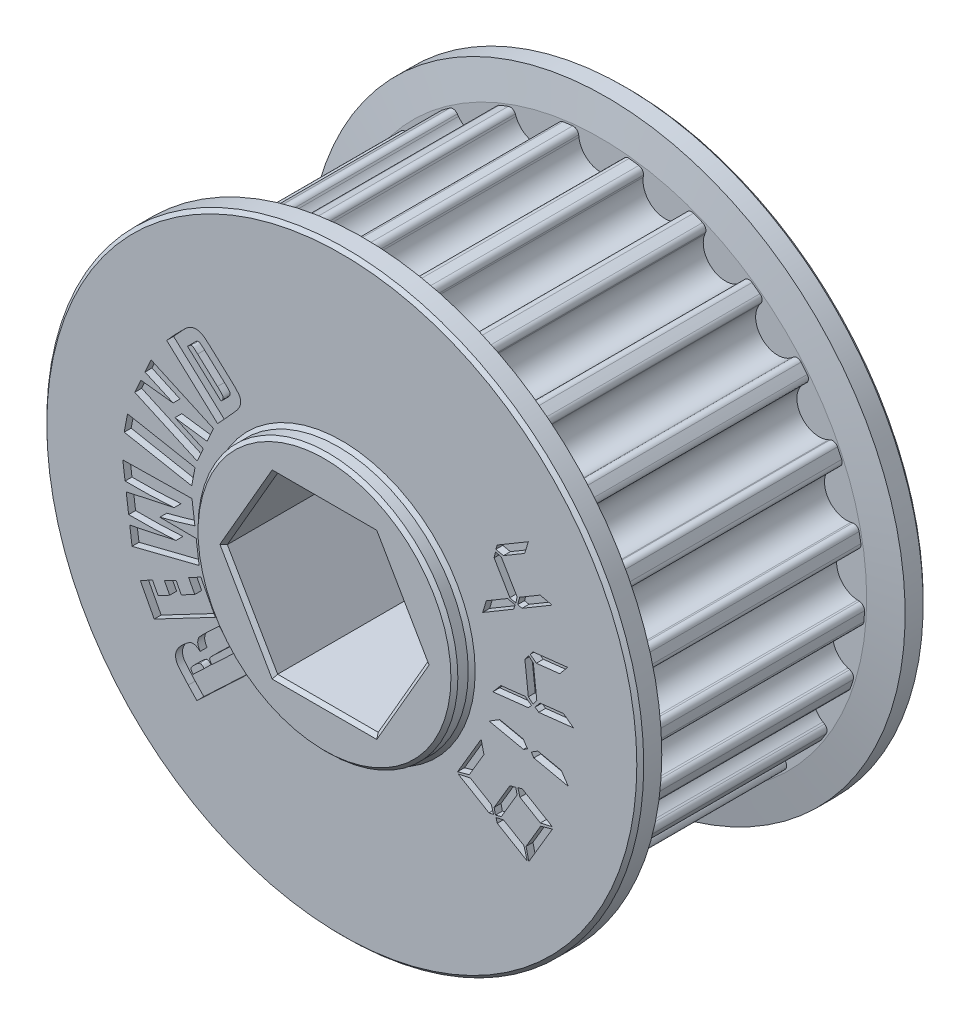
from build123d import *
from OCP.BRepFilletAPI import BRepFilletAPI_MakeChamfer

# Parameters (mm, degrees)
SKETCH2_R                                 = 19.346823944
PULLEY_DEPTH                              = 8.500000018
CUT_TOOTH_DEPTH                           = 8.500000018
BLEND_TOOTH_R                             = 0.4
TOOTH_PATTERN_COUNT                       = 25
BLEND_TOOTH_OF_TOOTH_PATTERN_R            = 0.4
SIDEWALL_START                            = 8.500000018
SKETCH3_R                                 = 21.886823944
SIDEWALL_DEPTH                            = 2.000000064
SIDEWALL_CHAMFER_SIZE                     = 2.400000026
SIDEWALL_CHAMFER_SIZE2                    = 0.423184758
BEARING_SPACER_MANUAL_SUPPRESS_DEPTH      = 11.770000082
BEARING_SPACER_MANUAL_SUPPRESS_DEPTH_BACK = 11.770000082
SKETCH5_R                                 = 9.525
HEX_SHAFT_DEPTH                           = 63.5
CHAMFERS_SIZE                             = 0.254
CUT_EXTRUDE_START                         = 9.992000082
CUT_EXTRUDE_4419_DEPTH                    = 2.54


with BuildPart() as part:
    # Sketch2 → pulley (new, symmetric)
    with BuildSketch(Plane.XY):
        Circle(SKETCH2_R)
    extrude(amount=PULLEY_DEPTH, both=True)

    # tooth → cut tooth (cut, symmetric)
    with BuildSketch(Plane.XY):
        with BuildLine():
            Line((-2.132711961, 22.982416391), (-1.612887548, 18.748786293))
            ThreePointArc((-1.612887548, 18.748786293), (0, 17.32182393), (1.612887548, 18.748786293))
            Line((1.612887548, 18.748786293), (2.132711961, 22.982416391))
            Line((2.132711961, 22.982416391), (-2.132711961, 22.982416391))
        make_face()
    cut_tooth = extrude(amount=CUT_TOOTH_DEPTH, both=True, mode=Mode.SUBTRACT)

    # blend tooth
    blend_tooth_edges = [part.edges().sort_by_distance(p)[0] for p in [
        (1.677372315, 19.273972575, 0),
        (-1.677372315, 19.273972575, 0),
    ]]
    fillet(blend_tooth_edges, radius=BLEND_TOOTH_R)

    # tooth pattern: cut tooth ×25 about axis
    tooth_pattern_axis = Axis((0, 0, 0), (0, 0, 1))
    for i in range(1, TOOTH_PATTERN_COUNT):
        add(cut_tooth.rotate(tooth_pattern_axis, i * 360 / TOOTH_PATTERN_COUNT), mode=Mode.SUBTRACT)

    # blend tooth of tooth pattern
    blend_tooth_of_tooth_pattern_edges = [part.edges().sort_by_distance(p)[0] for p in [
        (-3.168567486, 19.085590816, 0),
        (-6.417916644, 18.251299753, 0),
        (-7.815414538, 17.697991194, 0),
        (-10.755199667, 16.081830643, 0),
        (-11.971190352, 15.198361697, 0),
        (-14.41669394, 12.901880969, 0),
        (-15.374772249, 11.743763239, 0),
        (-17.172334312, 8.911258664, 0),
        (-17.812300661, 7.551260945, 0),
        (-18.848973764, 4.360709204, 0),
        (-19.130616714, 2.884285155, 0),
        (-19.341262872, -0.463839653, 0),
        (-19.246885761, -1.963920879, 0),
        (-18.618269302, -5.259243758, 0),
        (-18.153802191, -6.688726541, 0),
        (-16.725421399, -9.724190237, 0),
        (-15.920048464, -10.993254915, 0),
        (-13.781653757, -13.578130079, 0),
        (-12.685979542, -14.607036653, 0),
        (-9.971934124, -16.578906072, 0),
        (-8.654803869, -17.303004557, 0),
        (-5.535641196, -18.537968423, 0),
        (-4.07981504, -18.911761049, 0),
        (-0.751523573, -19.332222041, 0),
        (0.751523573, -19.332222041, 0),
        (4.07981504, -18.911761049, 0),
        (5.535641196, -18.537968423, 0),
        (8.654803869, -17.303004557, 0),
        (9.971934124, -16.578906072, 0),
        (12.685979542, -14.607036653, 0),
        (13.781653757, -13.578130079, 0),
        (15.920048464, -10.993254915, 0),
        (16.725421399, -9.724190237, 0),
        (18.153802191, -6.688726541, 0),
        (18.618269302, -5.259243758, 0),
        (19.246885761, -1.963920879, 0),
        (19.341262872, -0.463839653, 0),
        (19.130616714, 2.884285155, 0),
        (18.848973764, 4.360709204, 0),
        (17.812300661, 7.551260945, 0),
        (17.172334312, 8.911258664, 0),
        (15.374772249, 11.743763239, 0),
        (14.41669394, 12.901880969, 0),
        (11.971190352, 15.198361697, 0),
        (10.755199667, 16.081830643, 0),
        (7.815414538, 17.697991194, 0),
        (6.417916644, 18.251299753, 0),
        (3.168567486, 19.085590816, 0),
    ]]
    fillet(blend_tooth_of_tooth_pattern_edges, radius=BLEND_TOOTH_OF_TOOTH_PATTERN_R)

    # Sketch3 → sidewall (add)
    with BuildSketch(Plane.XY.offset(SIDEWALL_START)):
        Circle(SKETCH3_R)
    sidewall = extrude(amount=SIDEWALL_DEPTH)

    # mirror sidewall: sidewall across plane
    add(sidewall.mirror(Plane.XY))

    # sidewall chamfer: one chamfer whose edges measure the first distance from different faces: ONE call of the kernel's chamfer builder (chamfer() names one face for all edges)
    sidewall_chamfer_edges_1 = [part.edges().sort_by_distance(p)[0] for p in [
        (-21.886823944, 0, 8.500000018),
    ]]
    sidewall_chamfer_side_1 = [part.faces().sort_by_distance(p)[0] for p in [
        (-21.267771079, 0, 8.500000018),
    ]]
    sidewall_chamfer_edges_2 = [part.edges().sort_by_distance(p)[0] for p in [
        (-21.886823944, 0, -8.500000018),
    ]]
    sidewall_chamfer_side_2 = [part.faces().sort_by_distance(p)[0] for p in [
        (-21.267771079, 0, -8.500000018),
    ]]
    sidewall_chamfer = BRepFilletAPI_MakeChamfer(part.part.solid().wrapped)
    for e in sidewall_chamfer_edges_1:
        sidewall_chamfer.Add(SIDEWALL_CHAMFER_SIZE, SIDEWALL_CHAMFER_SIZE2, e.wrapped, sidewall_chamfer_side_1[0].wrapped)  # the first distance lies on this face
    for e in sidewall_chamfer_edges_2:
        sidewall_chamfer.Add(SIDEWALL_CHAMFER_SIZE, SIDEWALL_CHAMFER_SIZE2, e.wrapped, sidewall_chamfer_side_2[0].wrapped)  # the first distance lies on this face
    add(Compound.cast(sidewall_chamfer.Shape()), mode=Mode.REPLACE)

    # Sketch5 → bearing spacer _Manual Suppress (add, two sides: drawn at the far end of the back side and taken through both)
    with BuildSketch(Plane.XY.offset(-BEARING_SPACER_MANUAL_SUPPRESS_DEPTH_BACK)):
        Circle(SKETCH5_R)
    extrude(amount=BEARING_SPACER_MANUAL_SUPPRESS_DEPTH + BEARING_SPACER_MANUAL_SUPPRESS_DEPTH_BACK)

    # Sketch4 → hex shaft (cut, symmetric)
    with BuildSketch(Plane.XY):
        Polygon((3.688171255, 6.3881), (-3.688171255, 6.3881), (-7.376342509, 0), (-3.688171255, -6.3881), (3.688171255, -6.3881), (7.376342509, 0), align=None)
    extrude(amount=HEX_SHAFT_DEPTH, both=True, mode=Mode.SUBTRACT)

    # chamfers
    chamfers_edges = [part.edges().sort_by_distance(p)[0] for p in [
        (-21.886823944, 0, 10.500000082),
        (-21.886823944, 0, -10.500000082),
        (-9.525, 0, -10.500000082),
        (-9.525, 0, 10.500000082),
        (-9.525, 0, -11.770000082),
        (-9.525, 0, 11.770000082),
        (0, 6.3881, 11.770000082),
        (-5.532256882, 3.19405, 11.770000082),
        (-5.532256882, -3.19405, 11.770000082),
        (0, -6.3881, 11.770000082),
        (5.532256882, -3.19405, 11.770000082),
        (5.532256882, 3.19405, 11.770000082),
        (5.532256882, 3.19405, -11.770000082),
        (5.532256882, -3.19405, -11.770000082),
        (0, -6.3881, -11.770000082),
        (-5.532256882, -3.19405, -11.770000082),
        (-5.532256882, 3.19405, -11.770000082),
        (0, 6.3881, -11.770000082),
    ]]
    chamfer(chamfers_edges, length=CHAMFERS_SIZE)

    # Sketch6 → Cut-Extrude 4419 (cut)
    # profile 1 of 22: a face of its own
    with BuildSketch(Plane.XY.offset(CUT_EXTRUDE_START)):
        Polygon((11.392131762, 8.850099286), (13.677688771, 10.201222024), (13.40912544, 9.326314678), (11.854503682, 8.405723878), (11.292458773, 8.523393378), align=None)
    # profile 2 of 22: a face of its own
    with BuildSketch(Plane.XY.offset(CUT_EXTRUDE_START)):
        Polygon((12.60620414, 5.382309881), (10.328953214, 4.035340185), (10.597516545, 4.911631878), (12.152138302, 5.830838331), (12.716951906, 5.710400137), align=None)
    # profile 3 of 22: a face of its own
    with BuildSketch(Plane.XY.offset(CUT_EXTRUDE_START)):
        Polygon((13.046426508, 6.359658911), (14.542905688, 7.245641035), (15.419197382, 7.046295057), (13.218085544, 5.745008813), (12.89414833, 5.814226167), align=None)
    # profile 4 of 22: a face of its own
    with BuildSketch(Plane.XY.offset(CUT_EXTRUDE_START)):
        Polygon((12.854002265, 6.286288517), (12.757097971, 5.843297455), (12.322412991, 5.972041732), (11.167867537, 7.925355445), (11.273077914, 8.353118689), (11.699456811, 8.239602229), align=None)
    # profile 5 of 22: a face of its own
    with BuildSketch(Plane.XY.offset(CUT_EXTRUDE_START)):
        Polygon((14.031043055, 3.379982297), (16.558860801, 3.663773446), (15.98297242, 2.970215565), (14.263613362, 2.777791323), (13.816469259, 3.121109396), align=None)
    # profile 6 of 22: a face of its own
    with BuildSketch(Plane.XY.offset(CUT_EXTRUDE_START)):
        Polygon((13.673881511, -0.338373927), (11.074077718, -0.630471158), (11.670731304, 0.06447107), (13.445464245, 0.263817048), (13.906451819, -0.083654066), align=None)
    # profile 7 of 22: a face of its own
    with BuildSketch(Plane.XY.offset(CUT_EXTRUDE_START)):
        Polygon((14.534945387, 0.38563959), (16.263994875, 0.579448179), (16.981086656, 0.032631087), (14.43942544, -0.252544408), (14.172246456, -0.054582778), align=None)
    # profile 8 of 22: a face of its own
    with BuildSketch(Plane.XY.offset(CUT_EXTRUDE_START)):
        Polygon((14.298222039, 0.423016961), (14.025505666, 0.060318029), (13.678034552, 0.353799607), (13.424699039, 2.608900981), (13.697415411, 2.975752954), (14.044886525, 2.678118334), align=None)
    # profile 9 of 22: a face of its own
    with BuildSketch(Plane.XY.offset(CUT_EXTRUDE_START)):
        Polygon((13.32375599, -3.165051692), (10.804244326, -2.625156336), (11.582247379, -2.143403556), (13.301606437, -2.511639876), (13.622774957, -2.987855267), align=None)
    # profile 10 of 22: a face of its own
    with BuildSketch(Plane.XY.offset(CUT_EXTRUDE_START)):
        Polygon((14.375859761, -2.742825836), (16.09521882, -3.111062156), (16.607427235, -3.86968435), (14.079609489, -3.327020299), (13.888569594, -3.044613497), align=None)
    # profile 11 of 22: a face of its own
    with BuildSketch(Plane.XY.offset(CUT_EXTRUDE_START)):
        Polygon((13.712643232, -10.094065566), (13.509144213, -9.226079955), (14.584781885, -7.405663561), (15.444461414, -7.166171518), align=None)
    # profile 12 of 22: a face of its own
    with BuildSketch(Plane.XY.offset(CUT_EXTRUDE_START)):
        Polygon((8.485348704, -7.002818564), (10.217166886, -4.074924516), (10.420665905, -4.942910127), (9.345028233, -6.763326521), align=None)
    # profile 13 of 22: a face of its own
    with BuildSketch(Plane.XY.offset(CUT_EXTRUDE_START)):
        Polygon((13.235043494, -5.718144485), (15.436155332, -7.019430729), (14.559863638, -7.218776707), (13.063384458, -6.332794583), (12.908337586, -5.79151488), align=None)
    # profile 14 of 22: a face of its own
    with BuildSketch(Plane.XY.offset(CUT_EXTRUDE_START)):
        Polygon((10.791670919, -8.457767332), (8.533800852, -7.123256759), (9.425320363, -6.932216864), (10.96609865, -7.844501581), (11.129451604, -8.396856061), align=None)
    # profile 15 of 22: a face of its own
    with BuildSketch(Plane.XY.offset(CUT_EXTRUDE_START)):
        Polygon((11.857618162, -8.370553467), (13.354097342, -9.25653559), (13.601895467, -10.120368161), (11.400783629, -8.819081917), (11.306648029, -8.500682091), align=None)
    # profile 16 of 22: a face of its own
    with BuildSketch(Plane.XY.offset(CUT_EXTRUDE_START)):
        Polygon((11.701186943, -8.239040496), (11.266501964, -8.366400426), (11.169597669, -7.924793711), (12.324143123, -5.971479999), (12.75052202, -5.856579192), (12.855732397, -6.285726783), align=None)
    # profile 17 of 22: a face of its own
    with BuildSketch(Plane.XY.offset(CUT_EXTRUDE_START)):
        with BuildLine():
            Line((-12.843214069, 9.727965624), (-12.17605404, 10.455105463))
            add(Edge.make_bspline(
                [(-12.17605404, 10.455105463), (-12.124197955, 10.511204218), (-12.0250833, 10.618428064), (-11.880869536, 10.770440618), (-11.74720201, 10.905964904), (-11.624816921, 11.025689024), (-11.514233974, 11.12997546), (-11.413528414, 11.216686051), (-11.324276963, 11.28825528), (-11.221891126, 11.361182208), (-11.100975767, 11.429293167), (-10.959149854, 11.489263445), (-10.819550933, 11.523648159), (-10.683809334, 11.532705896), (-10.553834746, 11.520898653), (-10.430039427, 11.494215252), (-10.312505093, 11.451928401), (-10.219587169, 11.400484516), (-10.142720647, 11.348975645), (-10.075359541, 11.298606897), (-9.997873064, 11.237259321), (-9.909502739, 11.166100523), (-9.81260979, 11.081935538), (-9.704635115, 10.988178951), (-9.586649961, 10.883160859), (-9.505465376, 10.808638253), (-9.463121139, 10.769768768)],
                knots=[0, 0, 0, 0, 1.636426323, 3.127768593, 4.488225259, 5.71361905, 6.7951469, 7.743500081, 8.559501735, 9.245022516, 10.434114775, 11.524318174, 12.534298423, 13.498517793, 14.424332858, 15.321233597, 16.205018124, 17.089490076, 17.588371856, 18.186648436, 18.890510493, 19.705500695, 20.616687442, 21.639396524, 22.768756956, 24, 24, 24, 24], degree=3))
            Line((-9.463121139, 10.769768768), (-8.155561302, 9.571095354))
            add(Edge.make_bspline(
                [(-8.155561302, 9.571095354), (-8.115430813, 9.53433963), (-8.038561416, 9.463934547), (-7.930759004, 9.360677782), (-7.834814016, 9.265289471), (-7.749352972, 9.179325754), (-7.677484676, 9.099516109), (-7.616487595, 9.028517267), (-7.566052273, 8.966559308), (-7.517227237, 8.89440315), (-7.471348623, 8.808978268), (-7.432242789, 8.706159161), (-7.412898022, 8.602137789), (-7.409917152, 8.498403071), (-7.424103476, 8.394996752), (-7.449408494, 8.290814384), (-7.491460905, 8.187137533), (-7.535743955, 8.100306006), (-7.579623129, 8.029094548), (-7.618533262, 7.970260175), (-7.665059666, 7.908187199), (-7.716595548, 7.840463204), (-7.774715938, 7.768997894), (-7.838597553, 7.692649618), (-7.909769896, 7.612989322), (-7.959291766, 7.558208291), (-7.984849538, 7.529936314)],
                knots=[0, 0, 0, 0, 1.570847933, 3.008937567, 4.308575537, 5.476420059, 6.50729723, 7.407756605, 8.178744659, 8.811646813, 9.919952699, 10.970600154, 11.973647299, 12.959571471, 13.952943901, 14.977992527, 16.046422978, 17.174190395, 17.787867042, 18.460151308, 19.209568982, 20.026481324, 20.916726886, 21.86826782, 22.899833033, 24, 24, 24, 24], degree=3))
            Line((-7.984849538, 7.529936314), (-9.107856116, 6.304502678))
            Line((-9.107856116, 6.304502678), (-12.843214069, 9.727965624))
        make_face()
        with BuildLine():
            Line((-11.313267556, 10.113681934), (-8.856863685, 7.86213218))
            add(Edge.make_bspline(
                [(-8.856863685, 7.86213218), (-8.841786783, 7.878796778), (-8.812996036, 7.910619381), (-8.776873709, 7.959865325), (-8.74503889, 8.004642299), (-8.723242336, 8.048567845), (-8.706785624, 8.089098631), (-8.698046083, 8.127734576), (-8.696667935, 8.163895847), (-8.703943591, 8.199114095), (-8.720029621, 8.23594934), (-8.746796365, 8.277110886), (-8.783301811, 8.325143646), (-8.829453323, 8.380293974), (-8.885946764, 8.442320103), (-8.953837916, 8.510143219), (-9.031028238, 8.586186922), (-9.087375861, 8.637752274), (-9.117083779, 8.664938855)],
                knots=[0, 0, 0, 0, 1.06638621, 2.036363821, 2.89935106, 3.670262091, 4.359321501, 4.972510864, 5.542411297, 6.063817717, 6.666122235, 7.44034784, 8.389869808, 9.530793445, 10.854413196, 12.372875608, 14.087686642, 16, 16, 16, 16], degree=3))
            Line((-9.117083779, 8.664938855), (-10.568595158, 9.994645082))
            add(Edge.make_bspline(
                [(-10.568595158, 9.994645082), (-10.588910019, 10.013083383), (-10.627609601, 10.048208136), (-10.682569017, 10.098552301), (-10.733951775, 10.141459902), (-10.778460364, 10.180442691), (-10.818577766, 10.212907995), (-10.853052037, 10.239811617), (-10.883160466, 10.259929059), (-10.914068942, 10.281127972), (-10.950632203, 10.298304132), (-10.994597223, 10.308978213), (-11.038786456, 10.310151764), (-11.084491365, 10.299980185), (-11.134091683, 10.277442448), (-11.186912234, 10.236196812), (-11.249137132, 10.18195668), (-11.290610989, 10.137802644), (-11.313267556, 10.113681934)],
                knots=[0, 0, 0, 0, 1.429259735, 2.722723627, 3.88198304, 4.916103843, 5.804518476, 6.570479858, 7.192729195, 7.690497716, 8.522035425, 9.279908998, 10.03319502, 10.803168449, 11.69963882, 12.847099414, 14.277616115, 16, 16, 16, 16], degree=3))
        make_face(mode=Mode.SUBTRACT)
    # profile 18 of 22: a face of its own
    with BuildSketch(Plane.XY.offset(CUT_EXTRUDE_START)):
        Polygon((-13.980448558, 7.916440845), (-9.405373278, 5.841139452), (-9.87782962, 4.798413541), (-12.238265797, 5.12230451), (-10.158350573, 4.179237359), (-10.60958329, 3.184495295), (-15.18465857, 5.259796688), (-14.733425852, 6.254538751), (-12.371144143, 5.987859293), (-14.430758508, 6.921698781), align=None)
    # profile 19 of 22: a face of its own
    with BuildSketch(Plane.XY.offset(CUT_EXTRUDE_START)):
        Polygon((-15.713049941, 3.62876242), (-10.764254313, 2.693077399), (-11.006941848, 1.405818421), (-15.955737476, 2.341503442), align=None)
    # profile 20 of 22: a face of its own
    with BuildSketch(Plane.XY.offset(CUT_EXTRUDE_START)):
        with BuildLine():
            Line((-16.059578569, 0.529154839), (-10.988055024, 0.610358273))
            Line((-10.988055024, 0.610358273), (-10.773973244, -1.012787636))
            add(Edge.make_bspline(
                [(-10.773973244, -1.012787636), (-10.868920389, -1.044159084), (-11.0620648, -1.107975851), (-11.358047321, -1.199394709), (-11.663700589, -1.291999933), (-11.979356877, -1.384081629), (-12.304940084, -1.476652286), (-12.641046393, -1.567559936), (-12.986898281, -1.659364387), (-13.2213897, -1.71834963), (-13.340186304, -1.748232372)],
                knots=[0, 0, 0, 0, 0.898774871, 1.82831556, 2.784287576, 3.769411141, 4.783760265, 5.826673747, 6.898962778, 8, 8, 8, 8], degree=3))
            add(Edge.make_bspline(
                [(-13.340186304, -1.748232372), (-13.311888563, -1.747848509), (-13.251603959, -1.747030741), (-13.155632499, -1.747382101), (-13.048592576, -1.747356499), (-12.930783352, -1.746996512), (-12.802216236, -1.748665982), (-12.662873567, -1.747852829), (-12.512466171, -1.749385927), (-12.351283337, -1.749741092), (-12.179352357, -1.752388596), (-11.996633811, -1.752509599), (-11.802859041, -1.754860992), (-11.59831111, -1.756532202), (-11.383000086, -1.758502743), (-11.156916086, -1.760014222), (-10.919771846, -1.763139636), (-10.757978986, -1.764876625), (-10.675237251, -1.765764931)],
                knots=[0, 0, 0, 0, 0.509708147, 1.085865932, 1.72850346, 2.437620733, 3.207697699, 4.044234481, 4.947268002, 5.916780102, 6.947275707, 8.044205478, 9.207653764, 10.437578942, 11.72844153, 13.085781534, 14.509653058, 16, 16, 16, 16], degree=3))
            Line((-10.675237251, -1.765764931), (-10.463001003, -3.378760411))
            Line((-10.463001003, -3.378760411), (-15.38226811, -4.617112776))
            Line((-15.38226811, -4.617112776), (-15.548366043, -3.354768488))
            Line((-15.548366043, -3.354768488), (-13.821870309, -2.993044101))
            Line((-13.821870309, -2.993044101), (-12.158122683, -2.635010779))
            add(Edge.make_bspline(
                [(-12.158122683, -2.635010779), (-12.271906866, -2.643370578), (-12.508277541, -2.660736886), (-12.876537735, -2.680456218), (-13.271200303, -2.69705458), (-13.69202481, -2.709589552), (-14.139270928, -2.719611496), (-14.612961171, -2.727451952), (-15.11312625, -2.729588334), (-15.45516694, -2.729287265), (-15.630492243, -2.729132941)],
                knots=[0, 0, 0, 0, 0.788062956, 1.637090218, 2.547248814, 3.516550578, 4.54515188, 5.637359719, 6.788943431, 8, 8, 8, 8], degree=3))
            Line((-15.630492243, -2.729132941), (-15.808586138, -1.377280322))
            add(Edge.make_bspline(
                [(-15.808586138, -1.377280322), (-15.798139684, -1.3744666), (-15.77393385, -1.367946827), (-15.732917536, -1.358213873), (-15.682550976, -1.345892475), (-15.622821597, -1.332286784), (-15.553623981, -1.316557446), (-15.475173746, -1.299090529), (-15.387253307, -1.279484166), (-15.289840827, -1.258924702), (-15.183467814, -1.233914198), (-15.067428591, -1.210143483), (-14.942623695, -1.181314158), (-14.807851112, -1.153738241), (-14.6642147, -1.121513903), (-14.510459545, -1.089855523), (-14.347856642, -1.054574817), (-14.23619699, -1.030606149), (-14.178980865, -1.018324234)],
                knots=[0, 0, 0, 0, 0.31117638, 0.721037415, 1.212453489, 1.802656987, 2.483054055, 3.253652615, 4.114458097, 5.074118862, 6.117264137, 7.257359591, 8.480911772, 9.80144741, 11.214062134, 12.71504147, 14.316736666, 16, 16, 16, 16], degree=3))
            Line((-14.178980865, -1.018324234), (-12.301151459, -0.62614856))
            add(Edge.make_bspline(
                [(-12.301151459, -0.62614856), (-12.604052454, -0.64599318), (-13.207077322, -0.685500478), (-14.108901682, -0.719829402), (-15.003547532, -0.739487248), (-15.597572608, -0.734667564), (-15.893480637, -0.732266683)],
                knots=[0, 0, 0, 0, 1.013221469, 2.017153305, 3.012263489, 4, 4, 4, 4], degree=3))
            Line((-15.893480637, -0.732266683), (-16.059578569, 0.529154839))
        make_face()
    # profile 21 of 22: a face of its own
    with BuildSketch(Plane.XY.offset(CUT_EXTRUDE_START)):
        Polygon((-13.756146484, -8.428054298), (-14.776726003, -6.484708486), (-13.879797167, -6.014097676), (-13.471011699, -6.791989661), (-12.621143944, -6.345370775), (-13.004091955, -5.61730817), (-12.1514559, -5.169766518), (-11.768507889, -5.897829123), (-10.782993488, -5.380157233), (-11.232380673, -4.52475288), (-10.335451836, -4.05414207), (-9.2742706, -6.075000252), align=None)
    # profile 22 of 22: a face of its own
    with BuildSketch(Plane.XY.offset(CUT_EXTRUDE_START)):
        with BuildLine():
            Line((-10.627262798, -12.041932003), (-11.261203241, -11.372003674))
            add(Edge.make_bspline(
                [(-11.261203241, -11.372003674), (-11.311788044, -11.318306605), (-11.408653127, -11.215481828), (-11.545584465, -11.065703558), (-11.667817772, -10.927717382), (-11.776326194, -10.802337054), (-11.869547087, -10.688558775), (-11.949355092, -10.587559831), (-12.014053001, -10.497804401), (-12.067139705, -10.418534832), (-12.108186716, -10.343621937), (-12.140013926, -10.26881954), (-12.163947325, -10.19212943), (-12.180670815, -10.113345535), (-12.189819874, -10.03240706), (-12.191949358, -9.949586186), (-12.184796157, -9.864732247), (-12.171414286, -9.777415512), (-12.147347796, -9.687449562), (-12.110464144, -9.595102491), (-12.06140857, -9.500387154), (-11.999477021, -9.40314989), (-11.926572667, -9.302333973), (-11.840487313, -9.199436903), (-11.74203333, -9.093672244), (-11.670328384, -9.024455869), (-11.633078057, -8.98849834)],
                knots=[0, 0, 0, 0, 1.842777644, 3.528743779, 5.069072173, 6.447507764, 7.670369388, 8.743203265, 9.662306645, 10.433763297, 11.1248523, 11.792743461, 12.461032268, 13.128613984, 13.801480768, 14.493167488, 15.194432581, 15.925820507, 16.697430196, 17.514993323, 18.405021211, 19.35793148, 20.392270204, 21.51082159, 22.706885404, 24, 24, 24, 24], degree=3))
            add(Edge.make_bspline(
                [(-11.633078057, -8.98849834), (-11.598906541, -8.956504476), (-11.533507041, -8.895272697), (-11.435234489, -8.812299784), (-11.343345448, -8.73946987), (-11.255995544, -8.680032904), (-11.175084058, -8.630764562), (-11.099408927, -8.59373314), (-11.029203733, -8.566822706), (-10.962585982, -8.552382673), (-10.897535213, -8.548468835), (-10.831545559, -8.555169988), (-10.763646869, -8.572711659), (-10.692885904, -8.598177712), (-10.621396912, -8.636572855), (-10.545772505, -8.681229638), (-10.469589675, -8.738434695), (-10.419117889, -8.78093076), (-10.392880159, -8.803022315)],
                knots=[0, 0, 0, 0, 1.549881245, 2.966255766, 4.258045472, 5.430518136, 6.462907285, 7.392217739, 8.217203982, 8.946395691, 9.640226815, 10.366924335, 11.132757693, 11.957743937, 12.850614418, 13.814881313, 14.864067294, 16, 16, 16, 16], degree=3))
            add(Edge.make_bspline(
                [(-10.392880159, -8.803022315), (-10.408165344, -8.774837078), (-10.437617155, -8.720529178), (-10.476659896, -8.640404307), (-10.508065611, -8.564481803), (-10.533374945, -8.493115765), (-10.552154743, -8.42599657), (-10.563574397, -8.362976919), (-10.5675356, -8.304433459), (-10.563392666, -8.23412613), (-10.549702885, -8.154401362), (-10.528047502, -8.067568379), (-10.50087583, -7.99140755), (-10.469616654, -7.934172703), (-10.435832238, -7.888340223), (-10.398893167, -7.845995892), (-10.35182652, -7.793113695), (-10.293074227, -7.730939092), (-10.222575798, -7.659609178), (-10.140100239, -7.579681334), (-10.04727547, -7.489169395), (-9.981089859, -7.426181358), (-9.946261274, -7.39303542)],
                knots=[0, 0, 0, 0, 1.150284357, 2.216391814, 3.196002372, 4.096457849, 4.931733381, 5.693739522, 6.390373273, 7.031285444, 8.215992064, 9.286602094, 10.239812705, 11.109095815, 11.614563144, 12.280084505, 13.124134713, 14.154636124, 15.348558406, 16.722018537, 18.275041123, 20, 20, 20, 20], degree=3))
            Line((-9.946261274, -7.39303542), (-8.985661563, -6.484110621))
            Line((-8.985661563, -6.484110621), (-8.153326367, -7.363506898))
            Line((-8.153326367, -7.363506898), (-9.363072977, -8.507737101))
            add(Edge.make_bspline(
                [(-9.363072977, -8.507737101), (-9.386347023, -8.529676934), (-9.43051826, -8.571316), (-9.490228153, -8.633749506), (-9.543023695, -8.68959874), (-9.58760793, -8.740470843), (-9.624168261, -8.786132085), (-9.650839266, -8.828056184), (-9.670701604, -8.863741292), (-9.683772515, -8.895885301), (-9.685859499, -8.927325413), (-9.683284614, -8.959908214), (-9.672493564, -8.994687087), (-9.655379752, -9.031941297), (-9.632091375, -9.071959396), (-9.601414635, -9.113684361), (-9.564936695, -9.158806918), (-9.537361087, -9.188598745), (-9.522711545, -9.204425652)],
                knots=[0, 0, 0, 0, 1.773140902, 3.365200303, 4.789058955, 6.034070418, 7.115548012, 8.028585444, 8.784025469, 9.382894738, 9.931046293, 10.513167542, 11.187862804, 11.935951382, 12.784253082, 13.749780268, 14.804570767, 16, 16, 16, 16], degree=3))
            Line((-9.522711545, -9.204425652), (-7.88111031, -7.651409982))
            Line((-7.88111031, -7.651409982), (-6.986027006, -8.598168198))
            Line((-6.986027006, -8.598168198), (-10.627262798, -12.041932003))
        make_face()
        with BuildLine():
            Line((-10.899478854, -10.506448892), (-10.090212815, -9.740552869))
            add(Edge.make_bspline(
                [(-10.090212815, -9.740552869), (-10.114123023, -9.716473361), (-10.158208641, -9.672075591), (-10.224498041, -9.616391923), (-10.285685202, -9.578359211), (-10.335545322, -9.558533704), (-10.375876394, -9.555661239), (-10.409190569, -9.56201826), (-10.446151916, -9.576331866), (-10.486747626, -9.599324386), (-10.531933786, -9.62907023), (-10.581868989, -9.665943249), (-10.63540608, -9.711677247), (-10.671697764, -9.745627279), (-10.690933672, -9.763622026)],
                knots=[0, 0, 0, 0, 1.673915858, 3.086364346, 4.25738803, 5.22195583, 5.693315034, 6.232137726, 6.88035376, 7.640851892, 8.528863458, 9.548546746, 10.700640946, 12, 12, 12, 12], degree=3))
            Line((-10.690933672, -9.763622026), (-10.890251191, -9.95186635))
            add(Edge.make_bspline(
                [(-10.890251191, -9.95186635), (-10.916119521, -9.97771733), (-10.963148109, -10.024714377), (-11.018743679, -10.097198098), (-11.052509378, -10.164357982), (-11.064316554, -10.229666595), (-11.048685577, -10.293636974), (-11.017311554, -10.360510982), (-10.965489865, -10.432704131), (-10.922753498, -10.480447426), (-10.899478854, -10.506448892)],
                knots=[0, 0, 0, 0, 1.330936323, 2.419640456, 3.311475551, 4.048077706, 4.779552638, 5.666662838, 6.72924173, 8, 8, 8, 8], degree=3))
        make_face(mode=Mode.SUBTRACT)
    extrude(amount=CUT_EXTRUDE_4419_DEPTH, mode=Mode.SUBTRACT)


solid = part.part
